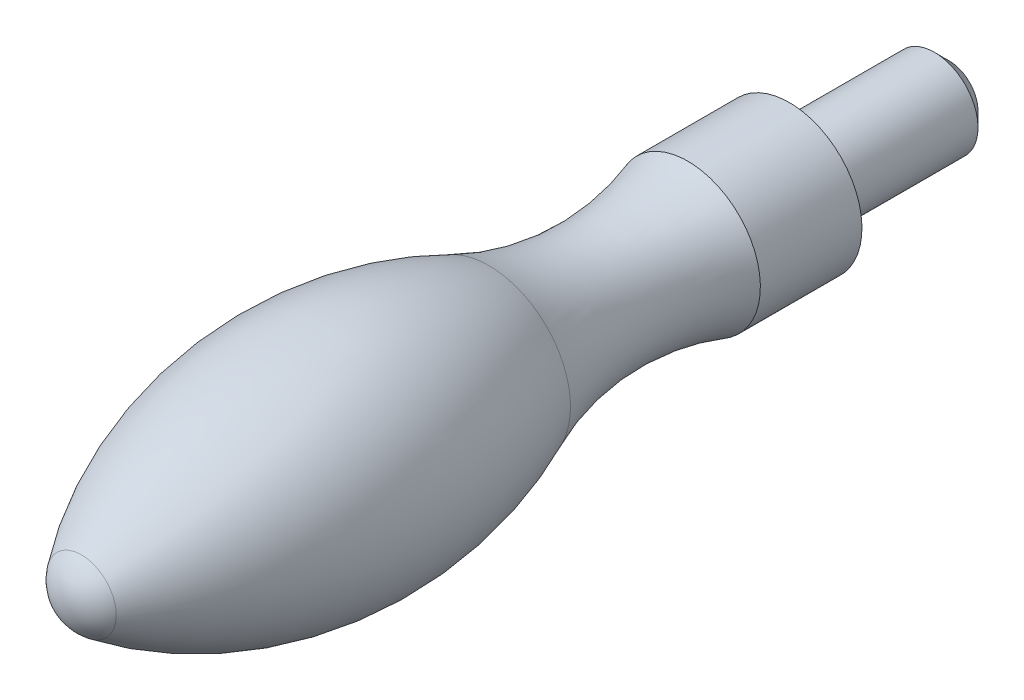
ISO-10303-21;
HEADER;
FILE_DESCRIPTION(('STEP AP214'),'2;1');
FILE_NAME('part.step','',(''),(''),'','','');
FILE_SCHEMA(('AUTOMOTIVE_DESIGN { 1 0 10303 214 1 1 1 1 }'));
ENDSEC;
DATA;
#1=APPLICATION_CONTEXT('core data for automotive mechanical design processes');
#2=APPLICATION_PROTOCOL_DEFINITION('international standard','automotive_design',2000,#1);
#3=PRODUCT_CONTEXT('',#1,'mechanical');
#4=PRODUCT('Part','Part','',(#3));
#5=PRODUCT_RELATED_PRODUCT_CATEGORY('part','',(#4));
#6=PRODUCT_DEFINITION_FORMATION('','',#4);
#7=PRODUCT_DEFINITION_CONTEXT('part definition',#1,'design');
#8=PRODUCT_DEFINITION('design','',#6,#7);
#9=PRODUCT_DEFINITION_SHAPE('','',#8);
#10=(LENGTH_UNIT() NAMED_UNIT(*) SI_UNIT(.MILLI.,.METRE.));
#11=(NAMED_UNIT(*) PLANE_ANGLE_UNIT() SI_UNIT($,.RADIAN.));
#12=(NAMED_UNIT(*) SI_UNIT($,.STERADIAN.) SOLID_ANGLE_UNIT());
#13=UNCERTAINTY_MEASURE_WITH_UNIT(LENGTH_MEASURE(1.E-05),#10,'distance_accuracy_value','');
#14=(GEOMETRIC_REPRESENTATION_CONTEXT(3) GLOBAL_UNCERTAINTY_ASSIGNED_CONTEXT((#13)) GLOBAL_UNIT_ASSIGNED_CONTEXT((#10,
#11,#12)) REPRESENTATION_CONTEXT('',''));
#15=CARTESIAN_POINT('',(0.,0.,0.));
#16=DIRECTION('',(0.,0.,1.));
#17=DIRECTION('',(1.,0.,0.));
#18=AXIS2_PLACEMENT_3D('',#15,#16,#17);
#19=CARTESIAN_POINT('',(0.,0.,-11.));
#20=DIRECTION('',(0.,0.,-1.));
#21=DIRECTION('',(0.,1.,0.));
#22=AXIS2_PLACEMENT_3D('',#19,#20,#21);
#23=PLANE('',#22);
#24=DIRECTION('',(0.866025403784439,0.5,0.));
#25=VECTOR('',#24,1.);
#26=CARTESIAN_POINT('',(-1.5,0.866025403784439,-11.));
#27=LINE('',#26,#25);
#28=CARTESIAN_POINT('',(-1.5,0.866025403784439,-11.));
#29=VERTEX_POINT('',#28);
#30=CARTESIAN_POINT('',(0.,1.73205080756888,-11.));
#31=VERTEX_POINT('',#30);
#32=EDGE_CURVE('E29',#29,#31,#27,.T.);
#33=ORIENTED_EDGE('',*,*,#32,.F.);
#34=DIRECTION('',(0.,1.,0.));
#35=VECTOR('',#34,1.);
#36=CARTESIAN_POINT('',(-1.5,-0.866025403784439,-11.));
#37=LINE('',#36,#35);
#38=CARTESIAN_POINT('',(-1.5,-0.866025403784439,-11.));
#39=VERTEX_POINT('',#38);
#40=EDGE_CURVE('E112',#39,#29,#37,.T.);
#41=ORIENTED_EDGE('',*,*,#40,.F.);
#42=DIRECTION('',(-0.866025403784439,0.5,0.));
#43=VECTOR('',#42,1.);
#44=CARTESIAN_POINT('',(0.,-1.73205080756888,-11.));
#45=LINE('',#44,#43);
#46=CARTESIAN_POINT('',(0.,-1.73205080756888,-11.));
#47=VERTEX_POINT('',#46);
#48=EDGE_CURVE('E110',#47,#39,#45,.T.);
#49=ORIENTED_EDGE('',*,*,#48,.F.);
#50=DIRECTION('',(-0.866025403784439,-0.5,0.));
#51=VECTOR('',#50,1.);
#52=CARTESIAN_POINT('',(1.5,-0.866025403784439,-11.));
#53=LINE('',#52,#51);
#54=CARTESIAN_POINT('',(1.5,-0.866025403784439,-11.));
#55=VERTEX_POINT('',#54);
#56=EDGE_CURVE('E77',#55,#47,#53,.T.);
#57=ORIENTED_EDGE('',*,*,#56,.F.);
#58=DIRECTION('',(0.,-1.,0.));
#59=VECTOR('',#58,1.);
#60=CARTESIAN_POINT('',(1.5,0.866025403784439,-11.));
#61=LINE('',#60,#59);
#62=CARTESIAN_POINT('',(1.5,0.866025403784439,-11.));
#63=VERTEX_POINT('',#62);
#64=EDGE_CURVE('E106',#63,#55,#61,.T.);
#65=ORIENTED_EDGE('',*,*,#64,.F.);
#66=DIRECTION('',(0.866025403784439,-0.5,0.));
#67=VECTOR('',#66,1.);
#68=CARTESIAN_POINT('',(0.,1.73205080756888,-11.));
#69=LINE('',#68,#67);
#70=EDGE_CURVE('E103',#31,#63,#69,.T.);
#71=ORIENTED_EDGE('',*,*,#70,.F.);
#72=EDGE_LOOP('',(#33,#41,#49,#57,#65,#71));
#73=FACE_BOUND('',#72,.T.);
#74=CARTESIAN_POINT('',(0.,0.,-11.));
#75=DIRECTION('',(0.,0.,-1.));
#76=DIRECTION('',(-1.,0.,0.));
#77=AXIS2_PLACEMENT_3D('',#74,#75,#76);
#78=CIRCLE('',#77,2.);
#79=CARTESIAN_POINT('',(-2.,0.,-11.));
#80=VERTEX_POINT('',#79);
#81=EDGE_CURVE('E9',#80,#80,#78,.T.);
#82=ORIENTED_EDGE('',*,*,#81,.T.);
#83=EDGE_LOOP('',(#82));
#84=FACE_BOUND('',#83,.T.);
#85=ADVANCED_FACE('F14',(#73,#84),#23,.T.);
#86=CARTESIAN_POINT('',(7.83483569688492E-07,0.,46.9999989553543));
#87=DIRECTION('',(0.,0.,1.));
#88=DIRECTION('',(-1.,0.,0.));
#89=AXIS2_PLACEMENT_3D('',#86,#87,#88);
#90=SPHERICAL_SURFACE('',#89,3.00000100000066);
#91=CARTESIAN_POINT('',(0.,0.,48.799999));
#92=DIRECTION('',(0.,0.,1.));
#93=DIRECTION('',(0.,-1.,0.));
#94=AXIS2_PLACEMENT_3D('',#91,#92,#93);
#95=CIRCLE('',#94,2.400002);
#96=CARTESIAN_POINT('',(0.,-2.400002,48.799999));
#97=VERTEX_POINT('',#96);
#98=EDGE_CURVE('E133',#97,#97,#95,.T.);
#99=ORIENTED_EDGE('',*,*,#98,.T.);
#100=EDGE_LOOP('',(#99));
#101=FACE_BOUND('',#100,.T.);
#102=ADVANCED_FACE('F155',(#101),#90,.T.);
#103=CARTESIAN_POINT('',(0.,0.,32.));
#104=DIRECTION('',(0.,0.,1.));
#105=DIRECTION('',(0.,-1.,0.));
#106=AXIS2_PLACEMENT_3D('',#103,#104,#105);
#107=DEGENERATE_TOROIDAL_SURFACE('',#106,20.,28.0000010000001,.F.);
#108=CARTESIAN_POINT('',(0.,0.,20.7110999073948));
#109=DIRECTION('',(0.,0.,1.));
#110=DIRECTION('',(0.,-1.,0.));
#111=AXIS2_PLACEMENT_3D('',#108,#109,#110);
#112=CIRCLE('',#111,5.62344221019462);
#113=CARTESIAN_POINT('',(0.,-5.62344221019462,20.7110999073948));
#114=VERTEX_POINT('',#113);
#115=EDGE_CURVE('E130',#114,#114,#112,.T.);
#116=ORIENTED_EDGE('',*,*,#115,.T.);
#117=EDGE_LOOP('',(#116));
#118=FACE_BOUND('',#117,.T.);
#119=ORIENTED_EDGE('',*,*,#98,.F.);
#120=EDGE_LOOP('',(#119));
#121=FACE_BOUND('',#120,.T.);
#122=ADVANCED_FACE('F160',(#118,#121),#107,.F.);
#123=CARTESIAN_POINT('',(0.,0.,13.0507757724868));
#124=DIRECTION('',(0.,0.,1.));
#125=DIRECTION('',(0.,-1.,0.));
#126=AXIS2_PLACEMENT_3D('',#123,#124,#125);
#127=TOROIDAL_SURFACE('',#126,23.0107780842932,19.0000003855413);
#128=CARTESIAN_POINT('',(0.,0.,7.));
#129=DIRECTION('',(0.,0.,1.));
#130=DIRECTION('',(0.,-1.,0.));
#131=AXIS2_PLACEMENT_3D('',#128,#129,#130);
#132=CIRCLE('',#131,5.);
#133=CARTESIAN_POINT('',(0.,-5.,7.));
#134=VERTEX_POINT('',#133);
#135=EDGE_CURVE('E127',#134,#134,#132,.T.);
#136=ORIENTED_EDGE('',*,*,#135,.T.);
#137=EDGE_LOOP('',(#136));
#138=FACE_BOUND('',#137,.T.);
#139=ORIENTED_EDGE('',*,*,#115,.F.);
#140=EDGE_LOOP('',(#139));
#141=FACE_BOUND('',#140,.T.);
#142=ADVANCED_FACE('F167',(#138,#141),#127,.F.);
#143=CARTESIAN_POINT('',(0.,0.,53.0000010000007));
#144=DIRECTION('',(0.,0.,1.));
#145=DIRECTION('',(0.,-1.,0.));
#146=AXIS2_PLACEMENT_3D('',#143,#144,#145);
#147=CYLINDRICAL_SURFACE('',#146,5.);
#148=CARTESIAN_POINT('',(0.,0.,0.));
#149=DIRECTION('',(0.,0.,1.));
#150=DIRECTION('',(0.,-1.,0.));
#151=AXIS2_PLACEMENT_3D('',#148,#149,#150);
#152=CIRCLE('',#151,5.);
#153=CARTESIAN_POINT('',(0.,-5.,0.));
#154=VERTEX_POINT('',#153);
#155=EDGE_CURVE('E124',#154,#154,#152,.T.);
#156=ORIENTED_EDGE('',*,*,#155,.T.);
#157=EDGE_LOOP('',(#156));
#158=FACE_BOUND('',#157,.T.);
#159=ORIENTED_EDGE('',*,*,#135,.F.);
#160=EDGE_LOOP('',(#159));
#161=FACE_BOUND('',#160,.T.);
#162=ADVANCED_FACE('F171',(#158,#161),#147,.T.);
#163=CARTESIAN_POINT('',(5.,0.,0.));
#164=DIRECTION('',(0.,0.,-1.));
#165=DIRECTION('',(0.,1.,0.));
#166=AXIS2_PLACEMENT_3D('',#163,#164,#165);
#167=PLANE('',#166);
#168=CARTESIAN_POINT('',(0.,0.,0.));
#169=DIRECTION('',(0.,0.,1.));
#170=DIRECTION('',(0.,-1.,0.));
#171=AXIS2_PLACEMENT_3D('',#168,#169,#170);
#172=CIRCLE('',#171,3.);
#173=CARTESIAN_POINT('',(0.,-3.,0.));
#174=VERTEX_POINT('',#173);
#175=EDGE_CURVE('E116',#174,#174,#172,.T.);
#176=ORIENTED_EDGE('',*,*,#175,.T.);
#177=EDGE_LOOP('',(#176));
#178=FACE_BOUND('',#177,.T.);
#179=ORIENTED_EDGE('',*,*,#155,.F.);
#180=EDGE_LOOP('',(#179));
#181=FACE_BOUND('',#180,.T.);
#182=ADVANCED_FACE('F151',(#178,#181),#167,.T.);
#183=CARTESIAN_POINT('',(0.,0.,53.0000010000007));
#184=DIRECTION('',(0.,0.,1.));
#185=DIRECTION('',(0.,-1.,0.));
#186=AXIS2_PLACEMENT_3D('',#183,#184,#185);
#187=CYLINDRICAL_SURFACE('',#186,3.);
#188=CARTESIAN_POINT('',(0.,0.,-10.));
#189=DIRECTION('',(0.,0.,-1.));
#190=DIRECTION('',(-1.,0.,0.));
#191=AXIS2_PLACEMENT_3D('',#188,#189,#190);
#192=CIRCLE('',#191,3.);
#193=CARTESIAN_POINT('',(-3.,0.,-10.));
#194=VERTEX_POINT('',#193);
#195=EDGE_CURVE('E22',#194,#194,#192,.F.);
#196=ORIENTED_EDGE('',*,*,#195,.T.);
#197=EDGE_LOOP('',(#196));
#198=FACE_BOUND('',#197,.T.);
#199=ORIENTED_EDGE('',*,*,#175,.F.);
#200=EDGE_LOOP('',(#199));
#201=FACE_BOUND('',#200,.T.);
#202=ADVANCED_FACE('F138',(#198,#201),#187,.T.);
#203=CARTESIAN_POINT('',(0.,0.,-10.));
#204=DIRECTION('',(0.,0.,1.));
#205=DIRECTION('',(1.,0.,0.));
#206=AXIS2_PLACEMENT_3D('',#203,#204,#205);
#207=CONICAL_SURFACE('',#206,3.,0.785398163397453);
#208=ORIENTED_EDGE('',*,*,#81,.F.);
#209=EDGE_LOOP('',(#208));
#210=FACE_BOUND('',#209,.T.);
#211=ORIENTED_EDGE('',*,*,#195,.F.);
#212=EDGE_LOOP('',(#211));
#213=FACE_BOUND('',#212,.T.);
#214=ADVANCED_FACE('F16',(#210,#213),#207,.T.);
#215=CARTESIAN_POINT('',(-1.5,0.866025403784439,-8.));
#216=DIRECTION('',(-0.5,0.866025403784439,0.));
#217=DIRECTION('',(-0.866025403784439,-0.5,0.));
#218=AXIS2_PLACEMENT_3D('',#215,#216,#217);
#219=PLANE('',#218);
#220=ORIENTED_EDGE('',*,*,#32,.T.);
#221=DIRECTION('',(0.,0.,-1.));
#222=VECTOR('',#221,1.);
#223=CARTESIAN_POINT('',(0.,1.73205080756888,-8.));
#224=LINE('',#223,#222);
#225=CARTESIAN_POINT('',(0.,1.73205080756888,-8.));
#226=VERTEX_POINT('',#225);
#227=EDGE_CURVE('E59',#226,#31,#224,.T.);
#228=ORIENTED_EDGE('',*,*,#227,.F.);
#229=DIRECTION('',(0.866025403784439,0.5,0.));
#230=VECTOR('',#229,1.);
#231=CARTESIAN_POINT('',(-1.5,0.866025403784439,-8.));
#232=LINE('',#231,#230);
#233=CARTESIAN_POINT('',(-1.5,0.866025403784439,-8.));
#234=VERTEX_POINT('',#233);
#235=EDGE_CURVE('E114',#234,#226,#232,.T.);
#236=ORIENTED_EDGE('',*,*,#235,.F.);
#237=DIRECTION('',(0.,0.,-1.));
#238=VECTOR('',#237,1.);
#239=CARTESIAN_POINT('',(-1.5,0.866025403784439,-8.));
#240=LINE('',#239,#238);
#241=EDGE_CURVE('E37',#234,#29,#240,.T.);
#242=ORIENTED_EDGE('',*,*,#241,.T.);
#243=EDGE_LOOP('',(#220,#228,#236,#242));
#244=FACE_BOUND('',#243,.T.);
#245=ADVANCED_FACE('F142',(#244),#219,.F.);
#246=CARTESIAN_POINT('',(-1.5,-0.866025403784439,-8.));
#247=DIRECTION('',(-1.,0.,0.));
#248=DIRECTION('',(0.,0.,1.));
#249=AXIS2_PLACEMENT_3D('',#246,#247,#248);
#250=PLANE('',#249);
#251=ORIENTED_EDGE('',*,*,#40,.T.);
#252=ORIENTED_EDGE('',*,*,#241,.F.);
#253=DIRECTION('',(0.,1.,0.));
#254=VECTOR('',#253,1.);
#255=CARTESIAN_POINT('',(-1.5,-0.866025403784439,-8.));
#256=LINE('',#255,#254);
#257=CARTESIAN_POINT('',(-1.5,-0.866025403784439,-8.));
#258=VERTEX_POINT('',#257);
#259=EDGE_CURVE('E89',#258,#234,#256,.T.);
#260=ORIENTED_EDGE('',*,*,#259,.F.);
#261=DIRECTION('',(0.,0.,-1.));
#262=VECTOR('',#261,1.);
#263=CARTESIAN_POINT('',(-1.5,-0.866025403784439,-8.));
#264=LINE('',#263,#262);
#265=EDGE_CURVE('E81',#258,#39,#264,.T.);
#266=ORIENTED_EDGE('',*,*,#265,.T.);
#267=EDGE_LOOP('',(#251,#252,#260,#266));
#268=FACE_BOUND('',#267,.T.);
#269=ADVANCED_FACE('F149',(#268),#250,.F.);
#270=CARTESIAN_POINT('',(0.,-1.73205080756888,-8.));
#271=DIRECTION('',(-0.5,-0.866025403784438,0.));
#272=DIRECTION('',(0.866025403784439,-0.5,0.));
#273=AXIS2_PLACEMENT_3D('',#270,#271,#272);
#274=PLANE('',#273);
#275=ORIENTED_EDGE('',*,*,#48,.T.);
#276=ORIENTED_EDGE('',*,*,#265,.F.);
#277=DIRECTION('',(-0.866025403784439,0.5,0.));
#278=VECTOR('',#277,1.);
#279=CARTESIAN_POINT('',(0.,-1.73205080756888,-8.));
#280=LINE('',#279,#278);
#281=CARTESIAN_POINT('',(0.,-1.73205080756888,-8.));
#282=VERTEX_POINT('',#281);
#283=EDGE_CURVE('E85',#282,#258,#280,.T.);
#284=ORIENTED_EDGE('',*,*,#283,.F.);
#285=DIRECTION('',(0.,0.,-1.));
#286=VECTOR('',#285,1.);
#287=CARTESIAN_POINT('',(0.,-1.73205080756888,-8.));
#288=LINE('',#287,#286);
#289=EDGE_CURVE('E70',#282,#47,#288,.T.);
#290=ORIENTED_EDGE('',*,*,#289,.T.);
#291=EDGE_LOOP('',(#275,#276,#284,#290));
#292=FACE_BOUND('',#291,.T.);
#293=ADVANCED_FACE('F86',(#292),#274,.F.);
#294=CARTESIAN_POINT('',(1.5,-0.866025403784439,-8.));
#295=DIRECTION('',(0.5,-0.866025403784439,0.));
#296=DIRECTION('',(0.866025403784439,0.5,0.));
#297=AXIS2_PLACEMENT_3D('',#294,#295,#296);
#298=PLANE('',#297);
#299=ORIENTED_EDGE('',*,*,#56,.T.);
#300=ORIENTED_EDGE('',*,*,#289,.F.);
#301=DIRECTION('',(-0.866025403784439,-0.5,0.));
#302=VECTOR('',#301,1.);
#303=CARTESIAN_POINT('',(1.5,-0.866025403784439,-8.));
#304=LINE('',#303,#302);
#305=CARTESIAN_POINT('',(1.5,-0.866025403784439,-8.));
#306=VERTEX_POINT('',#305);
#307=EDGE_CURVE('E74',#306,#282,#304,.T.);
#308=ORIENTED_EDGE('',*,*,#307,.F.);
#309=DIRECTION('',(0.,0.,-1.));
#310=VECTOR('',#309,1.);
#311=CARTESIAN_POINT('',(1.5,-0.866025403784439,-8.));
#312=LINE('',#311,#310);
#313=EDGE_CURVE('E82',#306,#55,#312,.T.);
#314=ORIENTED_EDGE('',*,*,#313,.T.);
#315=EDGE_LOOP('',(#299,#300,#308,#314));
#316=FACE_BOUND('',#315,.T.);
#317=ADVANCED_FACE('F72',(#316),#298,.F.);
#318=CARTESIAN_POINT('',(1.5,0.866025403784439,-8.));
#319=DIRECTION('',(1.,0.,0.));
#320=DIRECTION('',(0.,0.,-1.));
#321=AXIS2_PLACEMENT_3D('',#318,#319,#320);
#322=PLANE('',#321);
#323=ORIENTED_EDGE('',*,*,#64,.T.);
#324=ORIENTED_EDGE('',*,*,#313,.F.);
#325=DIRECTION('',(0.,-1.,0.));
#326=VECTOR('',#325,1.);
#327=CARTESIAN_POINT('',(1.5,0.866025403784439,-8.));
#328=LINE('',#327,#326);
#329=CARTESIAN_POINT('',(1.5,0.866025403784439,-8.));
#330=VERTEX_POINT('',#329);
#331=EDGE_CURVE('E95',#330,#306,#328,.T.);
#332=ORIENTED_EDGE('',*,*,#331,.F.);
#333=DIRECTION('',(0.,0.,-1.));
#334=VECTOR('',#333,1.);
#335=CARTESIAN_POINT('',(1.5,0.866025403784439,-8.));
#336=LINE('',#335,#334);
#337=EDGE_CURVE('E119',#330,#63,#336,.T.);
#338=ORIENTED_EDGE('',*,*,#337,.T.);
#339=EDGE_LOOP('',(#323,#324,#332,#338));
#340=FACE_BOUND('',#339,.T.);
#341=ADVANCED_FACE('F182',(#340),#322,.F.);
#342=CARTESIAN_POINT('',(0.,1.73205080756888,-8.));
#343=DIRECTION('',(0.5,0.866025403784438,0.));
#344=DIRECTION('',(-0.866025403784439,0.5,0.));
#345=AXIS2_PLACEMENT_3D('',#342,#343,#344);
#346=PLANE('',#345);
#347=ORIENTED_EDGE('',*,*,#70,.T.);
#348=ORIENTED_EDGE('',*,*,#337,.F.);
#349=DIRECTION('',(0.866025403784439,-0.5,0.));
#350=VECTOR('',#349,1.);
#351=CARTESIAN_POINT('',(0.,1.73205080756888,-8.));
#352=LINE('',#351,#350);
#353=EDGE_CURVE('E97',#226,#330,#352,.T.);
#354=ORIENTED_EDGE('',*,*,#353,.F.);
#355=ORIENTED_EDGE('',*,*,#227,.T.);
#356=EDGE_LOOP('',(#347,#348,#354,#355));
#357=FACE_BOUND('',#356,.T.);
#358=ADVANCED_FACE('F179',(#357),#346,.F.);
#359=CARTESIAN_POINT('',(0.,1.73205080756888,-8.));
#360=DIRECTION('',(0.,0.,-1.));
#361=DIRECTION('',(-1.,0.,0.));
#362=AXIS2_PLACEMENT_3D('',#359,#360,#361);
#363=PLANE('',#362);
#364=ORIENTED_EDGE('',*,*,#235,.T.);
#365=ORIENTED_EDGE('',*,*,#353,.T.);
#366=ORIENTED_EDGE('',*,*,#331,.T.);
#367=ORIENTED_EDGE('',*,*,#307,.T.);
#368=ORIENTED_EDGE('',*,*,#283,.T.);
#369=ORIENTED_EDGE('',*,*,#259,.T.);
#370=EDGE_LOOP('',(#364,#365,#366,#367,#368,#369));
#371=FACE_BOUND('',#370,.T.);
#372=ADVANCED_FACE('F92',(#371),#363,.T.);
#373=CLOSED_SHELL('',(#85,#102,#122,#142,#162,#182,#202,#214,#245,#269,#293,#317,#341,#358,#372));
#374=MANIFOLD_SOLID_BREP('B1',#373);
#375=ADVANCED_BREP_SHAPE_REPRESENTATION('',(#18,#374),#14);
#376=SHAPE_DEFINITION_REPRESENTATION(#9,#375);
ENDSEC;
END-ISO-10303-21;
